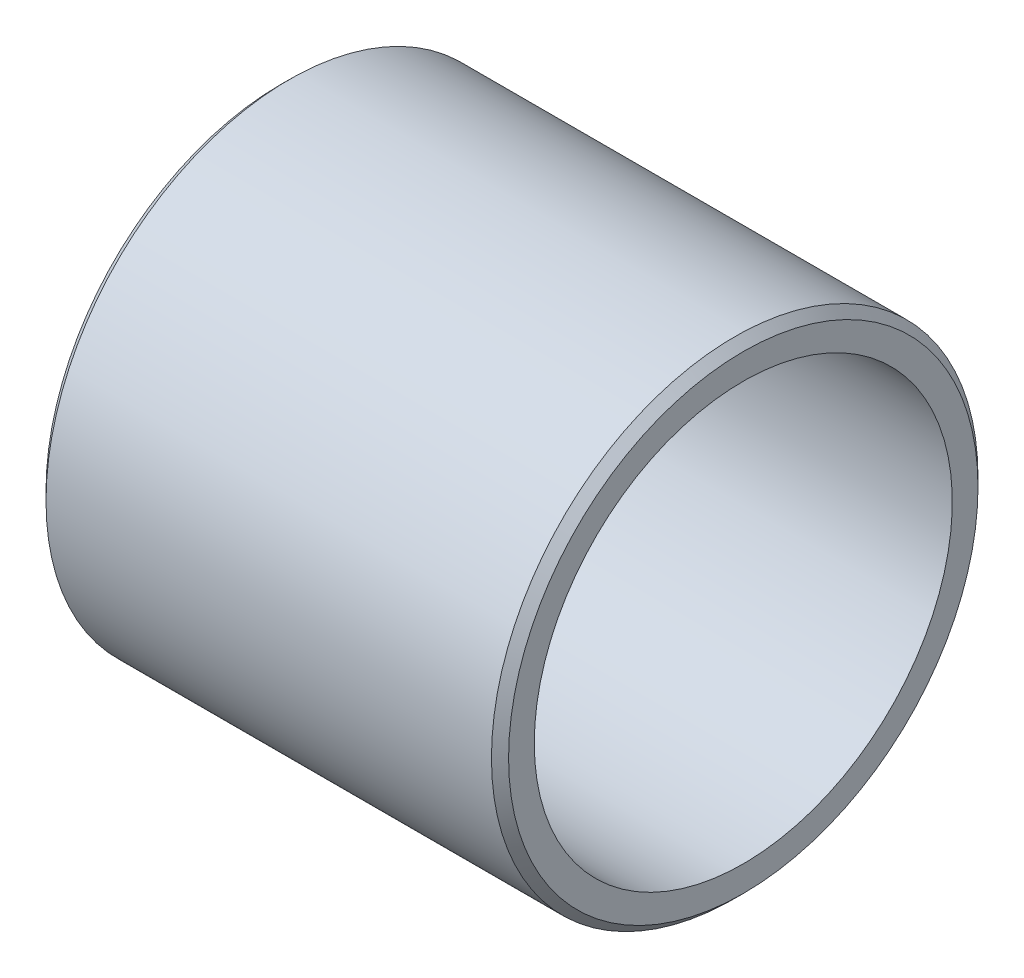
ISO-10303-21;
HEADER;
FILE_DESCRIPTION(('STEP AP214'),'2;1');
FILE_NAME('part.step','',(''),(''),'','','');
FILE_SCHEMA(('AUTOMOTIVE_DESIGN { 1 0 10303 214 1 1 1 1 }'));
ENDSEC;
DATA;
#1=APPLICATION_CONTEXT('core data for automotive mechanical design processes');
#2=APPLICATION_PROTOCOL_DEFINITION('international standard','automotive_design',2000,#1);
#3=PRODUCT_CONTEXT('',#1,'mechanical');
#4=PRODUCT('Part','Part','',(#3));
#5=PRODUCT_RELATED_PRODUCT_CATEGORY('part','',(#4));
#6=PRODUCT_DEFINITION_FORMATION('','',#4);
#7=PRODUCT_DEFINITION_CONTEXT('part definition',#1,'design');
#8=PRODUCT_DEFINITION('design','',#6,#7);
#9=PRODUCT_DEFINITION_SHAPE('','',#8);
#10=(LENGTH_UNIT() NAMED_UNIT(*) SI_UNIT(.MILLI.,.METRE.));
#11=(NAMED_UNIT(*) PLANE_ANGLE_UNIT() SI_UNIT($,.RADIAN.));
#12=(NAMED_UNIT(*) SI_UNIT($,.STERADIAN.) SOLID_ANGLE_UNIT());
#13=UNCERTAINTY_MEASURE_WITH_UNIT(LENGTH_MEASURE(1.E-05),#10,'distance_accuracy_value','');
#14=(GEOMETRIC_REPRESENTATION_CONTEXT(3) GLOBAL_UNCERTAINTY_ASSIGNED_CONTEXT((#13)) GLOBAL_UNIT_ASSIGNED_CONTEXT((#10,
#11,#12)) REPRESENTATION_CONTEXT('',''));
#15=CARTESIAN_POINT('',(0.,0.,0.));
#16=DIRECTION('',(0.,0.,1.));
#17=DIRECTION('',(1.,0.,0.));
#18=AXIS2_PLACEMENT_3D('',#15,#16,#17);
#19=CARTESIAN_POINT('',(0.,0.,0.));
#20=DIRECTION('',(-1.,0.,0.));
#21=DIRECTION('',(0.,0.,1.));
#22=AXIS2_PLACEMENT_3D('',#19,#20,#21);
#23=CYLINDRICAL_SURFACE('',#22,12.2);
#24=CARTESIAN_POINT('',(13.5,0.,0.));
#25=DIRECTION('',(-1.,0.,0.));
#26=DIRECTION('',(0.,0.,1.));
#27=AXIS2_PLACEMENT_3D('',#24,#25,#26);
#28=CIRCLE('',#27,12.2);
#29=CARTESIAN_POINT('',(13.5,0.,12.2));
#30=VERTEX_POINT('',#29);
#31=EDGE_CURVE('E52',#30,#30,#28,.T.);
#32=ORIENTED_EDGE('',*,*,#31,.F.);
#33=EDGE_LOOP('',(#32));
#34=FACE_BOUND('',#33,.T.);
#35=CARTESIAN_POINT('',(-13.5,0.,0.));
#36=DIRECTION('',(-1.,0.,0.));
#37=DIRECTION('',(0.,0.,1.));
#38=AXIS2_PLACEMENT_3D('',#35,#36,#37);
#39=CIRCLE('',#38,12.2);
#40=CARTESIAN_POINT('',(-13.5,0.,12.2));
#41=VERTEX_POINT('',#40);
#42=EDGE_CURVE('E49',#41,#41,#39,.T.);
#43=ORIENTED_EDGE('',*,*,#42,.T.);
#44=EDGE_LOOP('',(#43));
#45=FACE_BOUND('',#44,.T.);
#46=ADVANCED_FACE('F30',(#34,#45),#23,.F.);
#47=CARTESIAN_POINT('',(-13.5,12.2,0.));
#48=DIRECTION('',(-1.,0.,0.));
#49=DIRECTION('',(0.,0.,1.));
#50=AXIS2_PLACEMENT_3D('',#47,#48,#49);
#51=PLANE('',#50);
#52=CARTESIAN_POINT('',(-13.5,0.,0.));
#53=DIRECTION('',(-1.,0.,0.));
#54=DIRECTION('',(0.,0.,1.));
#55=AXIS2_PLACEMENT_3D('',#52,#53,#54);
#56=CIRCLE('',#55,13.7);
#57=CARTESIAN_POINT('',(-13.5,0.,13.7));
#58=VERTEX_POINT('',#57);
#59=EDGE_CURVE('E44',#58,#58,#56,.T.);
#60=ORIENTED_EDGE('',*,*,#59,.T.);
#61=EDGE_LOOP('',(#60));
#62=FACE_BOUND('',#61,.T.);
#63=ORIENTED_EDGE('',*,*,#42,.F.);
#64=EDGE_LOOP('',(#63));
#65=FACE_BOUND('',#64,.T.);
#66=ADVANCED_FACE('F60',(#62,#65),#51,.T.);
#67=CARTESIAN_POINT('',(0.,0.,0.));
#68=DIRECTION('',(-1.,0.,0.));
#69=DIRECTION('',(0.,0.,1.));
#70=AXIS2_PLACEMENT_3D('',#67,#68,#69);
#71=CYLINDRICAL_SURFACE('',#70,14.2);
#72=CARTESIAN_POINT('',(-13.,0.,0.));
#73=DIRECTION('',(-1.,0.,0.));
#74=DIRECTION('',(0.,0.,1.));
#75=AXIS2_PLACEMENT_3D('',#72,#73,#74);
#76=CIRCLE('',#75,14.2);
#77=CARTESIAN_POINT('',(-13.,0.,14.2));
#78=VERTEX_POINT('',#77);
#79=EDGE_CURVE('E36',#78,#78,#76,.F.);
#80=ORIENTED_EDGE('',*,*,#79,.T.);
#81=EDGE_LOOP('',(#80));
#82=FACE_BOUND('',#81,.T.);
#83=CARTESIAN_POINT('',(13.,0.,0.));
#84=DIRECTION('',(1.,0.,0.));
#85=DIRECTION('',(0.,0.,-1.));
#86=AXIS2_PLACEMENT_3D('',#83,#84,#85);
#87=CIRCLE('',#86,14.2);
#88=CARTESIAN_POINT('',(13.,0.,-14.2));
#89=VERTEX_POINT('',#88);
#90=EDGE_CURVE('E40',#89,#89,#87,.F.);
#91=ORIENTED_EDGE('',*,*,#90,.T.);
#92=EDGE_LOOP('',(#91));
#93=FACE_BOUND('',#92,.T.);
#94=ADVANCED_FACE('F64',(#82,#93),#71,.T.);
#95=CARTESIAN_POINT('',(13.5,14.2,0.));
#96=DIRECTION('',(1.,0.,0.));
#97=DIRECTION('',(0.,0.,-1.));
#98=AXIS2_PLACEMENT_3D('',#95,#96,#97);
#99=PLANE('',#98);
#100=CARTESIAN_POINT('',(13.5,0.,0.));
#101=DIRECTION('',(1.,0.,0.));
#102=DIRECTION('',(0.,0.,-1.));
#103=AXIS2_PLACEMENT_3D('',#100,#101,#102);
#104=CIRCLE('',#103,13.7);
#105=CARTESIAN_POINT('',(13.5,0.,-13.7));
#106=VERTEX_POINT('',#105);
#107=EDGE_CURVE('E10',#106,#106,#104,.T.);
#108=ORIENTED_EDGE('',*,*,#107,.T.);
#109=EDGE_LOOP('',(#108));
#110=FACE_BOUND('',#109,.T.);
#111=ORIENTED_EDGE('',*,*,#31,.T.);
#112=EDGE_LOOP('',(#111));
#113=FACE_BOUND('',#112,.T.);
#114=ADVANCED_FACE('F56',(#110,#113),#99,.T.);
#115=CARTESIAN_POINT('',(-13.5,0.,0.));
#116=DIRECTION('',(1.,0.,0.));
#117=DIRECTION('',(0.,0.,-1.));
#118=AXIS2_PLACEMENT_3D('',#115,#116,#117);
#119=CONICAL_SURFACE('',#118,13.7,0.785398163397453);
#120=ORIENTED_EDGE('',*,*,#79,.F.);
#121=EDGE_LOOP('',(#120));
#122=FACE_BOUND('',#121,.T.);
#123=ORIENTED_EDGE('',*,*,#59,.F.);
#124=EDGE_LOOP('',(#123));
#125=FACE_BOUND('',#124,.T.);
#126=ADVANCED_FACE('F73',(#122,#125),#119,.T.);
#127=CARTESIAN_POINT('',(13.,0.,0.));
#128=DIRECTION('',(-1.,0.,0.));
#129=DIRECTION('',(0.,0.,1.));
#130=AXIS2_PLACEMENT_3D('',#127,#128,#129);
#131=CONICAL_SURFACE('',#130,14.2,0.785398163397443);
#132=ORIENTED_EDGE('',*,*,#107,.F.);
#133=EDGE_LOOP('',(#132));
#134=FACE_BOUND('',#133,.T.);
#135=ORIENTED_EDGE('',*,*,#90,.F.);
#136=EDGE_LOOP('',(#135));
#137=FACE_BOUND('',#136,.T.);
#138=ADVANCED_FACE('F76',(#134,#137),#131,.T.);
#139=CLOSED_SHELL('',(#46,#66,#94,#114,#126,#138));
#140=MANIFOLD_SOLID_BREP('B2',#139);
#141=ADVANCED_BREP_SHAPE_REPRESENTATION('',(#18,#140),#14);
#142=SHAPE_DEFINITION_REPRESENTATION(#9,#141);
ENDSEC;
END-ISO-10303-21;
